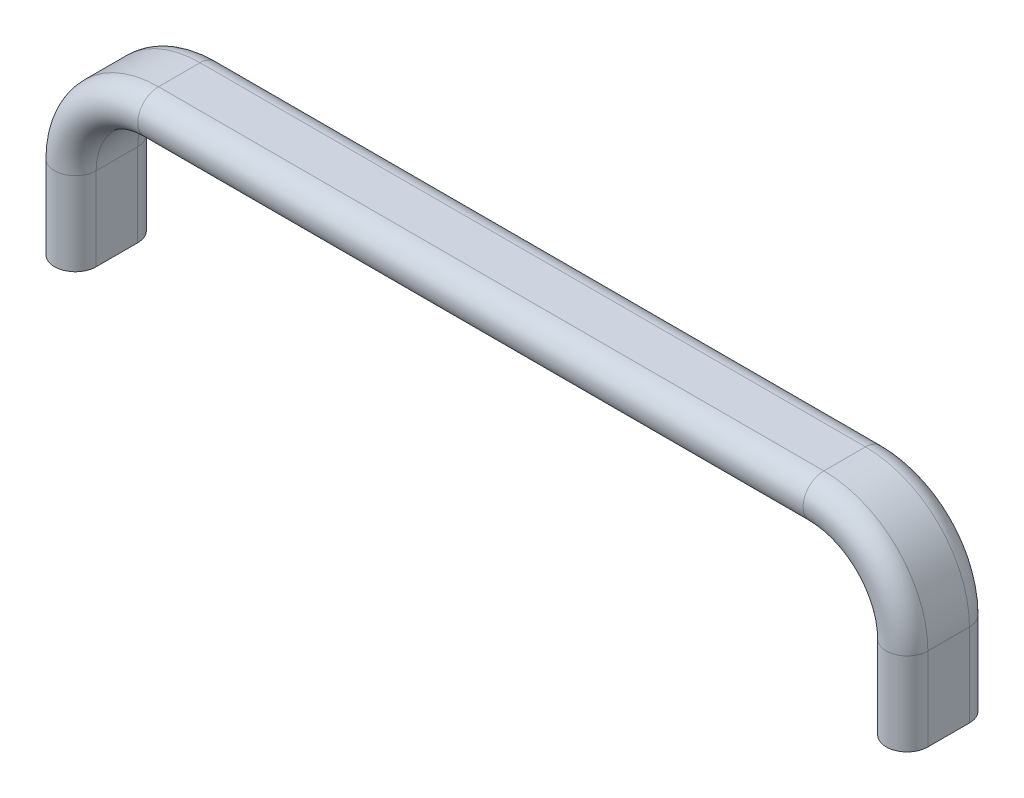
ISO-10303-21;
HEADER;
FILE_DESCRIPTION(('STEP AP214'),'2;1');
FILE_NAME('part.step','',(''),(''),'','','');
FILE_SCHEMA(('AUTOMOTIVE_DESIGN { 1 0 10303 214 1 1 1 1 }'));
ENDSEC;
DATA;
#1=APPLICATION_CONTEXT('core data for automotive mechanical design processes');
#2=APPLICATION_PROTOCOL_DEFINITION('international standard','automotive_design',2000,#1);
#3=PRODUCT_CONTEXT('',#1,'mechanical');
#4=PRODUCT('Part','Part','',(#3));
#5=PRODUCT_RELATED_PRODUCT_CATEGORY('part','',(#4));
#6=PRODUCT_DEFINITION_FORMATION('','',#4);
#7=PRODUCT_DEFINITION_CONTEXT('part definition',#1,'design');
#8=PRODUCT_DEFINITION('design','',#6,#7);
#9=PRODUCT_DEFINITION_SHAPE('','',#8);
#10=(LENGTH_UNIT() NAMED_UNIT(*) SI_UNIT(.MILLI.,.METRE.));
#11=(NAMED_UNIT(*) PLANE_ANGLE_UNIT() SI_UNIT($,.RADIAN.));
#12=(NAMED_UNIT(*) SI_UNIT($,.STERADIAN.) SOLID_ANGLE_UNIT());
#13=UNCERTAINTY_MEASURE_WITH_UNIT(LENGTH_MEASURE(1.E-05),#10,'distance_accuracy_value','');
#14=(GEOMETRIC_REPRESENTATION_CONTEXT(3) GLOBAL_UNCERTAINTY_ASSIGNED_CONTEXT((#13)) GLOBAL_UNIT_ASSIGNED_CONTEXT((#10,
#11,#12)) REPRESENTATION_CONTEXT('',''));
#15=CARTESIAN_POINT('',(0.,0.,0.));
#16=DIRECTION('',(0.,0.,1.));
#17=DIRECTION('',(1.,0.,0.));
#18=AXIS2_PLACEMENT_3D('',#15,#16,#17);
#19=CARTESIAN_POINT('',(100.,0.,-5.));
#20=DIRECTION('',(0.,1.,0.));
#21=DIRECTION('',(0.,0.,-1.));
#22=AXIS2_PLACEMENT_3D('',#19,#20,#21);
#23=PLANE('',#22);
#24=CARTESIAN_POINT('',(100.,0.,-5.));
#25=DIRECTION('',(0.,-1.,0.));
#26=DIRECTION('',(0.,0.,-1.));
#27=AXIS2_PLACEMENT_3D('',#24,#25,#26);
#28=CIRCLE('',#27,5.);
#29=CARTESIAN_POINT('',(95.,0.,-5.00000000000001));
#30=VERTEX_POINT('',#29);
#31=CARTESIAN_POINT('',(105.,0.,-5.00000000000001));
#32=VERTEX_POINT('',#31);
#33=EDGE_CURVE('E278',#30,#32,#28,.T.);
#34=ORIENTED_EDGE('',*,*,#33,.T.);
#35=DIRECTION('',(0.,0.,1.));
#36=VECTOR('',#35,1.);
#37=CARTESIAN_POINT('',(105.,0.,5.00000000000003));
#38=LINE('',#37,#36);
#39=CARTESIAN_POINT('',(105.,0.,5.00000000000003));
#40=VERTEX_POINT('',#39);
#41=EDGE_CURVE('E55',#32,#40,#38,.T.);
#42=ORIENTED_EDGE('',*,*,#41,.T.);
#43=CARTESIAN_POINT('',(100.,0.,5.00000000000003));
#44=DIRECTION('',(0.,-1.,0.));
#45=DIRECTION('',(0.,0.,1.));
#46=AXIS2_PLACEMENT_3D('',#43,#44,#45);
#47=CIRCLE('',#46,5.);
#48=CARTESIAN_POINT('',(95.,0.,5.00000000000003));
#49=VERTEX_POINT('',#48);
#50=EDGE_CURVE('E63',#40,#49,#47,.T.);
#51=ORIENTED_EDGE('',*,*,#50,.T.);
#52=DIRECTION('',(0.,0.,-1.));
#53=VECTOR('',#52,1.);
#54=CARTESIAN_POINT('',(95.,0.,-5.00000000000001));
#55=LINE('',#54,#53);
#56=EDGE_CURVE('E281',#49,#30,#55,.T.);
#57=ORIENTED_EDGE('',*,*,#56,.T.);
#58=EDGE_LOOP('',(#34,#42,#51,#57));
#59=FACE_BOUND('',#58,.T.);
#60=CARTESIAN_POINT('',(100.,0.,0.));
#61=DIRECTION('',(0.,1.,0.));
#62=DIRECTION('',(0.,0.,-1.));
#63=AXIS2_PLACEMENT_3D('',#60,#61,#62);
#64=CIRCLE('',#63,3.00000000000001);
#65=CARTESIAN_POINT('',(100.,0.,-3.00000000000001));
#66=VERTEX_POINT('',#65);
#67=EDGE_CURVE('E453',#66,#66,#64,.T.);
#68=ORIENTED_EDGE('',*,*,#67,.T.);
#69=EDGE_LOOP('',(#68));
#70=FACE_BOUND('',#69,.T.);
#71=ADVANCED_FACE('F37',(#59,#70),#23,.F.);
#72=CARTESIAN_POINT('',(105.,20.,5.00000000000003));
#73=DIRECTION('',(1.,0.,0.));
#74=DIRECTION('',(0.,0.,-1.));
#75=AXIS2_PLACEMENT_3D('',#72,#73,#74);
#76=PLANE('',#75);
#77=DIRECTION('',(0.,0.,1.));
#78=VECTOR('',#77,1.);
#79=CARTESIAN_POINT('',(105.,20.,5.00000000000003));
#80=LINE('',#79,#78);
#81=CARTESIAN_POINT('',(105.,20.,-5.00000000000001));
#82=VERTEX_POINT('',#81);
#83=CARTESIAN_POINT('',(105.,20.,5.00000000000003));
#84=VERTEX_POINT('',#83);
#85=EDGE_CURVE('E247',#82,#84,#80,.T.);
#86=ORIENTED_EDGE('',*,*,#85,.T.);
#87=DIRECTION('',(0.,-1.,0.));
#88=VECTOR('',#87,1.);
#89=CARTESIAN_POINT('',(105.,20.,5.00000000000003));
#90=LINE('',#89,#88);
#91=EDGE_CURVE('E47',#84,#40,#90,.T.);
#92=ORIENTED_EDGE('',*,*,#91,.T.);
#93=ORIENTED_EDGE('',*,*,#41,.F.);
#94=DIRECTION('',(0.,-1.,0.));
#95=VECTOR('',#94,1.);
#96=CARTESIAN_POINT('',(105.,20.,-5.00000000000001));
#97=LINE('',#96,#95);
#98=EDGE_CURVE('E11',#82,#32,#97,.T.);
#99=ORIENTED_EDGE('',*,*,#98,.F.);
#100=EDGE_LOOP('',(#86,#92,#93,#99));
#101=FACE_BOUND('',#100,.T.);
#102=ADVANCED_FACE('F39',(#101),#76,.T.);
#103=CARTESIAN_POINT('',(100.,20.,5.00000000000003));
#104=DIRECTION('',(0.,-1.,0.));
#105=DIRECTION('',(0.,0.,-1.));
#106=AXIS2_PLACEMENT_3D('',#103,#104,#105);
#107=CYLINDRICAL_SURFACE('',#106,5.);
#108=CARTESIAN_POINT('',(100.,20.,5.00000000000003));
#109=DIRECTION('',(0.,-1.,0.));
#110=DIRECTION('',(0.,0.,1.));
#111=AXIS2_PLACEMENT_3D('',#108,#109,#110);
#112=CIRCLE('',#111,5.);
#113=CARTESIAN_POINT('',(95.,20.,5.00000000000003));
#114=VERTEX_POINT('',#113);
#115=EDGE_CURVE('E240',#84,#114,#112,.T.);
#116=ORIENTED_EDGE('',*,*,#115,.T.);
#117=DIRECTION('',(0.,-1.,0.));
#118=VECTOR('',#117,1.);
#119=CARTESIAN_POINT('',(95.,20.,5.00000000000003));
#120=LINE('',#119,#118);
#121=EDGE_CURVE('E242',#114,#49,#120,.T.);
#122=ORIENTED_EDGE('',*,*,#121,.T.);
#123=ORIENTED_EDGE('',*,*,#50,.F.);
#124=ORIENTED_EDGE('',*,*,#91,.F.);
#125=EDGE_LOOP('',(#116,#122,#123,#124));
#126=FACE_BOUND('',#125,.T.);
#127=ADVANCED_FACE('F153',(#126),#107,.T.);
#128=CARTESIAN_POINT('',(95.,20.,-5.00000000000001));
#129=DIRECTION('',(-1.,0.,0.));
#130=DIRECTION('',(0.,0.,1.));
#131=AXIS2_PLACEMENT_3D('',#128,#129,#130);
#132=PLANE('',#131);
#133=DIRECTION('',(0.,0.,-1.));
#134=VECTOR('',#133,1.);
#135=CARTESIAN_POINT('',(95.,20.,-5.00000000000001));
#136=LINE('',#135,#134);
#137=CARTESIAN_POINT('',(95.,20.,-5.00000000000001));
#138=VERTEX_POINT('',#137);
#139=EDGE_CURVE('E248',#114,#138,#136,.T.);
#140=ORIENTED_EDGE('',*,*,#139,.T.);
#141=DIRECTION('',(0.,-1.,0.));
#142=VECTOR('',#141,1.);
#143=CARTESIAN_POINT('',(95.,20.,-5.00000000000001));
#144=LINE('',#143,#142);
#145=EDGE_CURVE('E289',#138,#30,#144,.T.);
#146=ORIENTED_EDGE('',*,*,#145,.T.);
#147=ORIENTED_EDGE('',*,*,#56,.F.);
#148=ORIENTED_EDGE('',*,*,#121,.F.);
#149=EDGE_LOOP('',(#140,#146,#147,#148));
#150=FACE_BOUND('',#149,.T.);
#151=ADVANCED_FACE('F231',(#150),#132,.T.);
#152=CARTESIAN_POINT('',(100.,20.,-5.));
#153=DIRECTION('',(0.,-1.,0.));
#154=DIRECTION('',(0.,0.,-1.));
#155=AXIS2_PLACEMENT_3D('',#152,#153,#154);
#156=CYLINDRICAL_SURFACE('',#155,5.);
#157=CARTESIAN_POINT('',(100.,20.,-5.));
#158=DIRECTION('',(0.,-1.,0.));
#159=DIRECTION('',(0.,0.,-1.));
#160=AXIS2_PLACEMENT_3D('',#157,#158,#159);
#161=CIRCLE('',#160,5.);
#162=EDGE_CURVE('E259',#138,#82,#161,.T.);
#163=ORIENTED_EDGE('',*,*,#162,.T.);
#164=ORIENTED_EDGE('',*,*,#98,.T.);
#165=ORIENTED_EDGE('',*,*,#33,.F.);
#166=ORIENTED_EDGE('',*,*,#145,.F.);
#167=EDGE_LOOP('',(#163,#164,#165,#166));
#168=FACE_BOUND('',#167,.T.);
#169=ADVANCED_FACE('F227',(#168),#156,.T.);
#170=CARTESIAN_POINT('',(80.,20.,0.));
#171=DIRECTION('',(0.,0.,-1.));
#172=DIRECTION('',(-1.,0.,0.));
#173=AXIS2_PLACEMENT_3D('',#170,#171,#172);
#174=CYLINDRICAL_SURFACE('',#173,25.);
#175=DIRECTION('',(0.,0.,1.));
#176=VECTOR('',#175,1.);
#177=CARTESIAN_POINT('',(80.,45.,5.00000000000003));
#178=LINE('',#177,#176);
#179=CARTESIAN_POINT('',(80.,45.,-5.00000000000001));
#180=VERTEX_POINT('',#179);
#181=CARTESIAN_POINT('',(80.,45.,5.00000000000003));
#182=VERTEX_POINT('',#181);
#183=EDGE_CURVE('E400',#180,#182,#178,.T.);
#184=ORIENTED_EDGE('',*,*,#183,.T.);
#185=CARTESIAN_POINT('',(80.,20.,5.00000000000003));
#186=DIRECTION('',(0.,0.,-1.));
#187=DIRECTION('',(-1.,0.,0.));
#188=AXIS2_PLACEMENT_3D('',#185,#186,#187);
#189=CIRCLE('',#188,25.);
#190=EDGE_CURVE('E265',#182,#84,#189,.T.);
#191=ORIENTED_EDGE('',*,*,#190,.T.);
#192=ORIENTED_EDGE('',*,*,#85,.F.);
#193=CARTESIAN_POINT('',(80.,20.,-5.00000000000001));
#194=DIRECTION('',(0.,0.,-1.));
#195=DIRECTION('',(-1.,0.,0.));
#196=AXIS2_PLACEMENT_3D('',#193,#194,#195);
#197=CIRCLE('',#196,25.);
#198=EDGE_CURVE('E269',#180,#82,#197,.T.);
#199=ORIENTED_EDGE('',*,*,#198,.F.);
#200=EDGE_LOOP('',(#184,#191,#192,#199));
#201=FACE_BOUND('',#200,.T.);
#202=ADVANCED_FACE('F223',(#201),#174,.T.);
#203=CARTESIAN_POINT('',(80.,20.,5.00000000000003));
#204=DIRECTION('',(0.,0.,-1.));
#205=DIRECTION('',(-1.,0.,0.));
#206=AXIS2_PLACEMENT_3D('',#203,#204,#205);
#207=TOROIDAL_SURFACE('',#206,20.,5.);
#208=CARTESIAN_POINT('',(80.,40.,5.00000000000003));
#209=DIRECTION('',(1.,0.,0.));
#210=DIRECTION('',(0.,0.,1.));
#211=AXIS2_PLACEMENT_3D('',#208,#209,#210);
#212=CIRCLE('',#211,5.);
#213=CARTESIAN_POINT('',(80.,35.,5.00000000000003));
#214=VERTEX_POINT('',#213);
#215=EDGE_CURVE('E262',#182,#214,#212,.T.);
#216=ORIENTED_EDGE('',*,*,#215,.T.);
#217=CARTESIAN_POINT('',(80.,20.,5.00000000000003));
#218=DIRECTION('',(0.,0.,-1.));
#219=DIRECTION('',(-1.,0.,0.));
#220=AXIS2_PLACEMENT_3D('',#217,#218,#219);
#221=CIRCLE('',#220,15.);
#222=EDGE_CURVE('E253',#214,#114,#221,.T.);
#223=ORIENTED_EDGE('',*,*,#222,.T.);
#224=ORIENTED_EDGE('',*,*,#115,.F.);
#225=ORIENTED_EDGE('',*,*,#190,.F.);
#226=EDGE_LOOP('',(#216,#223,#224,#225));
#227=FACE_BOUND('',#226,.T.);
#228=ADVANCED_FACE('F219',(#227),#207,.T.);
#229=CARTESIAN_POINT('',(80.,20.,0.));
#230=DIRECTION('',(0.,0.,-1.));
#231=DIRECTION('',(-1.,0.,0.));
#232=AXIS2_PLACEMENT_3D('',#229,#230,#231);
#233=CYLINDRICAL_SURFACE('',#232,15.);
#234=DIRECTION('',(0.,0.,-1.));
#235=VECTOR('',#234,1.);
#236=CARTESIAN_POINT('',(80.,35.,-5.00000000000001));
#237=LINE('',#236,#235);
#238=CARTESIAN_POINT('',(80.,35.,-5.00000000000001));
#239=VERTEX_POINT('',#238);
#240=EDGE_CURVE('E395',#214,#239,#237,.T.);
#241=ORIENTED_EDGE('',*,*,#240,.T.);
#242=CARTESIAN_POINT('',(80.,20.,-5.00000000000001));
#243=DIRECTION('',(0.,0.,-1.));
#244=DIRECTION('',(-1.,0.,0.));
#245=AXIS2_PLACEMENT_3D('',#242,#243,#244);
#246=CIRCLE('',#245,15.);
#247=EDGE_CURVE('E255',#239,#138,#246,.T.);
#248=ORIENTED_EDGE('',*,*,#247,.T.);
#249=ORIENTED_EDGE('',*,*,#139,.F.);
#250=ORIENTED_EDGE('',*,*,#222,.F.);
#251=EDGE_LOOP('',(#241,#248,#249,#250));
#252=FACE_BOUND('',#251,.T.);
#253=ADVANCED_FACE('F215',(#252),#233,.F.);
#254=CARTESIAN_POINT('',(80.,20.,-5.));
#255=DIRECTION('',(0.,0.,-1.));
#256=DIRECTION('',(-1.,0.,0.));
#257=AXIS2_PLACEMENT_3D('',#254,#255,#256);
#258=TOROIDAL_SURFACE('',#257,20.,5.);
#259=CARTESIAN_POINT('',(80.,40.,-5.));
#260=DIRECTION('',(1.,0.,0.));
#261=DIRECTION('',(0.,0.,-1.));
#262=AXIS2_PLACEMENT_3D('',#259,#260,#261);
#263=CIRCLE('',#262,5.);
#264=EDGE_CURVE('E391',#239,#180,#263,.T.);
#265=ORIENTED_EDGE('',*,*,#264,.T.);
#266=ORIENTED_EDGE('',*,*,#198,.T.);
#267=ORIENTED_EDGE('',*,*,#162,.F.);
#268=ORIENTED_EDGE('',*,*,#247,.F.);
#269=EDGE_LOOP('',(#265,#266,#267,#268));
#270=FACE_BOUND('',#269,.T.);
#271=ADVANCED_FACE('F211',(#270),#258,.T.);
#272=CARTESIAN_POINT('',(-80.,45.,5.00000000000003));
#273=DIRECTION('',(0.,1.,0.));
#274=DIRECTION('',(-1.,0.,0.));
#275=AXIS2_PLACEMENT_3D('',#272,#273,#274);
#276=PLANE('',#275);
#277=DIRECTION('',(0.,0.,1.));
#278=VECTOR('',#277,1.);
#279=CARTESIAN_POINT('',(-80.,45.,5.00000000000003));
#280=LINE('',#279,#278);
#281=CARTESIAN_POINT('',(-80.,45.,-5.00000000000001));
#282=VERTEX_POINT('',#281);
#283=CARTESIAN_POINT('',(-80.,45.,5.00000000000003));
#284=VERTEX_POINT('',#283);
#285=EDGE_CURVE('E372',#282,#284,#280,.T.);
#286=ORIENTED_EDGE('',*,*,#285,.T.);
#287=DIRECTION('',(1.,0.,0.));
#288=VECTOR('',#287,1.);
#289=CARTESIAN_POINT('',(-80.,45.,5.00000000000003));
#290=LINE('',#289,#288);
#291=EDGE_CURVE('E412',#284,#182,#290,.T.);
#292=ORIENTED_EDGE('',*,*,#291,.T.);
#293=ORIENTED_EDGE('',*,*,#183,.F.);
#294=DIRECTION('',(1.,0.,0.));
#295=VECTOR('',#294,1.);
#296=CARTESIAN_POINT('',(-80.,45.,-5.00000000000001));
#297=LINE('',#296,#295);
#298=EDGE_CURVE('E416',#282,#180,#297,.T.);
#299=ORIENTED_EDGE('',*,*,#298,.F.);
#300=EDGE_LOOP('',(#286,#292,#293,#299));
#301=FACE_BOUND('',#300,.T.);
#302=ADVANCED_FACE('F207',(#301),#276,.T.);
#303=CARTESIAN_POINT('',(-80.,40.,5.00000000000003));
#304=DIRECTION('',(1.,0.,0.));
#305=DIRECTION('',(0.,1.,0.));
#306=AXIS2_PLACEMENT_3D('',#303,#304,#305);
#307=CYLINDRICAL_SURFACE('',#306,5.);
#308=CARTESIAN_POINT('',(-80.,40.,5.00000000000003));
#309=DIRECTION('',(1.,0.,0.));
#310=DIRECTION('',(0.,0.,1.));
#311=AXIS2_PLACEMENT_3D('',#308,#309,#310);
#312=CIRCLE('',#311,5.);
#313=CARTESIAN_POINT('',(-80.,35.,5.00000000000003));
#314=VERTEX_POINT('',#313);
#315=EDGE_CURVE('E368',#284,#314,#312,.T.);
#316=ORIENTED_EDGE('',*,*,#315,.T.);
#317=DIRECTION('',(1.,0.,0.));
#318=VECTOR('',#317,1.);
#319=CARTESIAN_POINT('',(-80.,35.,5.00000000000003));
#320=LINE('',#319,#318);
#321=EDGE_CURVE('E408',#314,#214,#320,.T.);
#322=ORIENTED_EDGE('',*,*,#321,.T.);
#323=ORIENTED_EDGE('',*,*,#215,.F.);
#324=ORIENTED_EDGE('',*,*,#291,.F.);
#325=EDGE_LOOP('',(#316,#322,#323,#324));
#326=FACE_BOUND('',#325,.T.);
#327=ADVANCED_FACE('F203',(#326),#307,.T.);
#328=CARTESIAN_POINT('',(-80.,35.,-5.00000000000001));
#329=DIRECTION('',(0.,-1.,0.));
#330=DIRECTION('',(1.,0.,0.));
#331=AXIS2_PLACEMENT_3D('',#328,#329,#330);
#332=PLANE('',#331);
#333=DIRECTION('',(0.,0.,-1.));
#334=VECTOR('',#333,1.);
#335=CARTESIAN_POINT('',(-80.,35.,-5.00000000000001));
#336=LINE('',#335,#334);
#337=CARTESIAN_POINT('',(-80.,35.,-5.00000000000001));
#338=VERTEX_POINT('',#337);
#339=EDGE_CURVE('E364',#314,#338,#336,.T.);
#340=ORIENTED_EDGE('',*,*,#339,.T.);
#341=DIRECTION('',(1.,0.,0.));
#342=VECTOR('',#341,1.);
#343=CARTESIAN_POINT('',(-80.,35.,-5.00000000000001));
#344=LINE('',#343,#342);
#345=EDGE_CURVE('E404',#338,#239,#344,.T.);
#346=ORIENTED_EDGE('',*,*,#345,.T.);
#347=ORIENTED_EDGE('',*,*,#240,.F.);
#348=ORIENTED_EDGE('',*,*,#321,.F.);
#349=EDGE_LOOP('',(#340,#346,#347,#348));
#350=FACE_BOUND('',#349,.T.);
#351=ADVANCED_FACE('F199',(#350),#332,.T.);
#352=CARTESIAN_POINT('',(-80.,40.,-5.));
#353=DIRECTION('',(1.,0.,0.));
#354=DIRECTION('',(0.,1.,0.));
#355=AXIS2_PLACEMENT_3D('',#352,#353,#354);
#356=CYLINDRICAL_SURFACE('',#355,5.);
#357=CARTESIAN_POINT('',(-80.,40.,-5.));
#358=DIRECTION('',(1.,0.,0.));
#359=DIRECTION('',(0.,0.,-1.));
#360=AXIS2_PLACEMENT_3D('',#357,#358,#359);
#361=CIRCLE('',#360,5.);
#362=EDGE_CURVE('E360',#338,#282,#361,.T.);
#363=ORIENTED_EDGE('',*,*,#362,.T.);
#364=ORIENTED_EDGE('',*,*,#298,.T.);
#365=ORIENTED_EDGE('',*,*,#264,.F.);
#366=ORIENTED_EDGE('',*,*,#345,.F.);
#367=EDGE_LOOP('',(#363,#364,#365,#366));
#368=FACE_BOUND('',#367,.T.);
#369=ADVANCED_FACE('F195',(#368),#356,.T.);
#370=CARTESIAN_POINT('',(-80.,20.,0.));
#371=DIRECTION('',(0.,0.,-1.));
#372=DIRECTION('',(-1.,0.,0.));
#373=AXIS2_PLACEMENT_3D('',#370,#371,#372);
#374=CYLINDRICAL_SURFACE('',#373,25.);
#375=DIRECTION('',(0.,0.,1.));
#376=VECTOR('',#375,1.);
#377=CARTESIAN_POINT('',(-105.,20.,5.00000000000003));
#378=LINE('',#377,#376);
#379=CARTESIAN_POINT('',(-105.,20.,-5.00000000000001));
#380=VERTEX_POINT('',#379);
#381=CARTESIAN_POINT('',(-105.,20.,5.00000000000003));
#382=VERTEX_POINT('',#381);
#383=EDGE_CURVE('E326',#380,#382,#378,.T.);
#384=ORIENTED_EDGE('',*,*,#383,.T.);
#385=CARTESIAN_POINT('',(-80.,20.,5.00000000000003));
#386=DIRECTION('',(0.,0.,-1.));
#387=DIRECTION('',(-1.,0.,0.));
#388=AXIS2_PLACEMENT_3D('',#385,#386,#387);
#389=CIRCLE('',#388,25.);
#390=EDGE_CURVE('E384',#382,#284,#389,.T.);
#391=ORIENTED_EDGE('',*,*,#390,.T.);
#392=ORIENTED_EDGE('',*,*,#285,.F.);
#393=CARTESIAN_POINT('',(-80.,20.,-5.00000000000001));
#394=DIRECTION('',(0.,0.,-1.));
#395=DIRECTION('',(-1.,0.,0.));
#396=AXIS2_PLACEMENT_3D('',#393,#394,#395);
#397=CIRCLE('',#396,25.);
#398=EDGE_CURVE('E388',#380,#282,#397,.T.);
#399=ORIENTED_EDGE('',*,*,#398,.F.);
#400=EDGE_LOOP('',(#384,#391,#392,#399));
#401=FACE_BOUND('',#400,.T.);
#402=ADVANCED_FACE('F191',(#401),#374,.T.);
#403=CARTESIAN_POINT('',(-80.,20.,5.00000000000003));
#404=DIRECTION('',(0.,0.,-1.));
#405=DIRECTION('',(-1.,0.,0.));
#406=AXIS2_PLACEMENT_3D('',#403,#404,#405);
#407=TOROIDAL_SURFACE('',#406,20.,5.);
#408=CARTESIAN_POINT('',(-100.,20.,5.00000000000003));
#409=DIRECTION('',(0.,1.,0.));
#410=DIRECTION('',(0.,0.,1.));
#411=AXIS2_PLACEMENT_3D('',#408,#409,#410);
#412=CIRCLE('',#411,5.);
#413=CARTESIAN_POINT('',(-95.,20.,5.00000000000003));
#414=VERTEX_POINT('',#413);
#415=EDGE_CURVE('E331',#382,#414,#412,.T.);
#416=ORIENTED_EDGE('',*,*,#415,.T.);
#417=CARTESIAN_POINT('',(-80.,20.,5.00000000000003));
#418=DIRECTION('',(0.,0.,-1.));
#419=DIRECTION('',(-1.,0.,0.));
#420=AXIS2_PLACEMENT_3D('',#417,#418,#419);
#421=CIRCLE('',#420,15.);
#422=EDGE_CURVE('E380',#414,#314,#421,.T.);
#423=ORIENTED_EDGE('',*,*,#422,.T.);
#424=ORIENTED_EDGE('',*,*,#315,.F.);
#425=ORIENTED_EDGE('',*,*,#390,.F.);
#426=EDGE_LOOP('',(#416,#423,#424,#425));
#427=FACE_BOUND('',#426,.T.);
#428=ADVANCED_FACE('F187',(#427),#407,.T.);
#429=CARTESIAN_POINT('',(-80.,20.,0.));
#430=DIRECTION('',(0.,0.,-1.));
#431=DIRECTION('',(-1.,0.,0.));
#432=AXIS2_PLACEMENT_3D('',#429,#430,#431);
#433=CYLINDRICAL_SURFACE('',#432,15.);
#434=DIRECTION('',(0.,0.,-1.));
#435=VECTOR('',#434,1.);
#436=CARTESIAN_POINT('',(-95.,20.,-5.00000000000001));
#437=LINE('',#436,#435);
#438=CARTESIAN_POINT('',(-95.,20.,-5.00000000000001));
#439=VERTEX_POINT('',#438);
#440=EDGE_CURVE('E335',#414,#439,#437,.T.);
#441=ORIENTED_EDGE('',*,*,#440,.T.);
#442=CARTESIAN_POINT('',(-80.,20.,-5.00000000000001));
#443=DIRECTION('',(0.,0.,-1.));
#444=DIRECTION('',(-1.,0.,0.));
#445=AXIS2_PLACEMENT_3D('',#442,#443,#444);
#446=CIRCLE('',#445,15.);
#447=EDGE_CURVE('E376',#439,#338,#446,.T.);
#448=ORIENTED_EDGE('',*,*,#447,.T.);
#449=ORIENTED_EDGE('',*,*,#339,.F.);
#450=ORIENTED_EDGE('',*,*,#422,.F.);
#451=EDGE_LOOP('',(#441,#448,#449,#450));
#452=FACE_BOUND('',#451,.T.);
#453=ADVANCED_FACE('F183',(#452),#433,.F.);
#454=CARTESIAN_POINT('',(-80.,20.,-5.));
#455=DIRECTION('',(0.,0.,-1.));
#456=DIRECTION('',(-1.,0.,0.));
#457=AXIS2_PLACEMENT_3D('',#454,#455,#456);
#458=TOROIDAL_SURFACE('',#457,20.,5.);
#459=CARTESIAN_POINT('',(-100.,20.,-5.));
#460=DIRECTION('',(0.,1.,0.));
#461=DIRECTION('',(0.,0.,-1.));
#462=AXIS2_PLACEMENT_3D('',#459,#460,#461);
#463=CIRCLE('',#462,5.);
#464=EDGE_CURVE('E322',#439,#380,#463,.T.);
#465=ORIENTED_EDGE('',*,*,#464,.T.);
#466=ORIENTED_EDGE('',*,*,#398,.T.);
#467=ORIENTED_EDGE('',*,*,#362,.F.);
#468=ORIENTED_EDGE('',*,*,#447,.F.);
#469=EDGE_LOOP('',(#465,#466,#467,#468));
#470=FACE_BOUND('',#469,.T.);
#471=ADVANCED_FACE('F179',(#470),#458,.T.);
#472=CARTESIAN_POINT('',(-100.,20.,-5.));
#473=DIRECTION('',(0.,-1.,0.));
#474=DIRECTION('',(0.,0.,-1.));
#475=AXIS2_PLACEMENT_3D('',#472,#473,#474);
#476=CYLINDRICAL_SURFACE('',#475,5.);
#477=CARTESIAN_POINT('',(-100.,0.,-5.));
#478=DIRECTION('',(0.,1.,0.));
#479=DIRECTION('',(0.,0.,-1.));
#480=AXIS2_PLACEMENT_3D('',#477,#478,#479);
#481=CIRCLE('',#480,5.);
#482=CARTESIAN_POINT('',(-95.,0.,-5.00000000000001));
#483=VERTEX_POINT('',#482);
#484=CARTESIAN_POINT('',(-105.,0.,-5.00000000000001));
#485=VERTEX_POINT('',#484);
#486=EDGE_CURVE('E298',#483,#485,#481,.T.);
#487=ORIENTED_EDGE('',*,*,#486,.T.);
#488=DIRECTION('',(0.,-1.,0.));
#489=VECTOR('',#488,1.);
#490=CARTESIAN_POINT('',(-105.,20.,-5.00000000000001));
#491=LINE('',#490,#489);
#492=EDGE_CURVE('E356',#380,#485,#491,.T.);
#493=ORIENTED_EDGE('',*,*,#492,.F.);
#494=ORIENTED_EDGE('',*,*,#464,.F.);
#495=DIRECTION('',(0.,-1.,0.));
#496=VECTOR('',#495,1.);
#497=CARTESIAN_POINT('',(-95.,20.,-5.00000000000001));
#498=LINE('',#497,#496);
#499=EDGE_CURVE('E337',#439,#483,#498,.T.);
#500=ORIENTED_EDGE('',*,*,#499,.T.);
#501=EDGE_LOOP('',(#487,#493,#494,#500));
#502=FACE_BOUND('',#501,.T.);
#503=ADVANCED_FACE('F175',(#502),#476,.T.);
#504=CARTESIAN_POINT('',(-105.,20.,5.00000000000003));
#505=DIRECTION('',(1.,0.,0.));
#506=DIRECTION('',(0.,0.,-1.));
#507=AXIS2_PLACEMENT_3D('',#504,#505,#506);
#508=PLANE('',#507);
#509=DIRECTION('',(0.,0.,1.));
#510=VECTOR('',#509,1.);
#511=CARTESIAN_POINT('',(-105.,0.,5.00000000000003));
#512=LINE('',#511,#510);
#513=CARTESIAN_POINT('',(-105.,0.,5.00000000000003));
#514=VERTEX_POINT('',#513);
#515=EDGE_CURVE('E306',#485,#514,#512,.T.);
#516=ORIENTED_EDGE('',*,*,#515,.T.);
#517=DIRECTION('',(0.,-1.,0.));
#518=VECTOR('',#517,1.);
#519=CARTESIAN_POINT('',(-105.,20.,5.00000000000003));
#520=LINE('',#519,#518);
#521=EDGE_CURVE('E352',#382,#514,#520,.T.);
#522=ORIENTED_EDGE('',*,*,#521,.F.);
#523=ORIENTED_EDGE('',*,*,#383,.F.);
#524=ORIENTED_EDGE('',*,*,#492,.T.);
#525=EDGE_LOOP('',(#516,#522,#523,#524));
#526=FACE_BOUND('',#525,.T.);
#527=ADVANCED_FACE('F171',(#526),#508,.F.);
#528=CARTESIAN_POINT('',(-100.,20.,5.00000000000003));
#529=DIRECTION('',(0.,-1.,0.));
#530=DIRECTION('',(0.,0.,-1.));
#531=AXIS2_PLACEMENT_3D('',#528,#529,#530);
#532=CYLINDRICAL_SURFACE('',#531,5.);
#533=CARTESIAN_POINT('',(-100.,0.,5.00000000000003));
#534=DIRECTION('',(0.,1.,0.));
#535=DIRECTION('',(0.,0.,1.));
#536=AXIS2_PLACEMENT_3D('',#533,#534,#535);
#537=CIRCLE('',#536,5.);
#538=CARTESIAN_POINT('',(-95.,0.,5.00000000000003));
#539=VERTEX_POINT('',#538);
#540=EDGE_CURVE('E341',#514,#539,#537,.T.);
#541=ORIENTED_EDGE('',*,*,#540,.T.);
#542=DIRECTION('',(0.,-1.,0.));
#543=VECTOR('',#542,1.);
#544=CARTESIAN_POINT('',(-95.,20.,5.00000000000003));
#545=LINE('',#544,#543);
#546=EDGE_CURVE('E348',#414,#539,#545,.T.);
#547=ORIENTED_EDGE('',*,*,#546,.F.);
#548=ORIENTED_EDGE('',*,*,#415,.F.);
#549=ORIENTED_EDGE('',*,*,#521,.T.);
#550=EDGE_LOOP('',(#541,#547,#548,#549));
#551=FACE_BOUND('',#550,.T.);
#552=ADVANCED_FACE('F167',(#551),#532,.T.);
#553=CARTESIAN_POINT('',(-95.,20.,-5.00000000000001));
#554=DIRECTION('',(-1.,0.,0.));
#555=DIRECTION('',(0.,0.,1.));
#556=AXIS2_PLACEMENT_3D('',#553,#554,#555);
#557=PLANE('',#556);
#558=DIRECTION('',(0.,0.,-1.));
#559=VECTOR('',#558,1.);
#560=CARTESIAN_POINT('',(-95.,0.,-5.00000000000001));
#561=LINE('',#560,#559);
#562=EDGE_CURVE('E327',#539,#483,#561,.T.);
#563=ORIENTED_EDGE('',*,*,#562,.T.);
#564=ORIENTED_EDGE('',*,*,#499,.F.);
#565=ORIENTED_EDGE('',*,*,#440,.F.);
#566=ORIENTED_EDGE('',*,*,#546,.T.);
#567=EDGE_LOOP('',(#563,#564,#565,#566));
#568=FACE_BOUND('',#567,.T.);
#569=ADVANCED_FACE('F163',(#568),#557,.F.);
#570=CARTESIAN_POINT('',(-100.,0.,-5.));
#571=DIRECTION('',(0.,-1.,0.));
#572=DIRECTION('',(0.,0.,-1.));
#573=AXIS2_PLACEMENT_3D('',#570,#571,#572);
#574=PLANE('',#573);
#575=CARTESIAN_POINT('',(-100.,0.,0.));
#576=DIRECTION('',(0.,-1.,0.));
#577=DIRECTION('',(0.,0.,-1.));
#578=AXIS2_PLACEMENT_3D('',#575,#576,#577);
#579=CIRCLE('',#578,3.00000000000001);
#580=CARTESIAN_POINT('',(-100.,0.,-3.00000000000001));
#581=VERTEX_POINT('',#580);
#582=EDGE_CURVE('E310',#581,#581,#579,.T.);
#583=ORIENTED_EDGE('',*,*,#582,.F.);
#584=EDGE_LOOP('',(#583));
#585=FACE_BOUND('',#584,.T.);
#586=ORIENTED_EDGE('',*,*,#486,.F.);
#587=ORIENTED_EDGE('',*,*,#562,.F.);
#588=ORIENTED_EDGE('',*,*,#540,.F.);
#589=ORIENTED_EDGE('',*,*,#515,.F.);
#590=EDGE_LOOP('',(#586,#587,#588,#589));
#591=FACE_BOUND('',#590,.T.);
#592=ADVANCED_FACE('F159',(#585,#591),#574,.T.);
#593=CARTESIAN_POINT('',(-100.,12.,0.));
#594=DIRECTION('',(0.,-1.,0.));
#595=DIRECTION('',(0.,0.,-1.));
#596=AXIS2_PLACEMENT_3D('',#593,#594,#595);
#597=PLANE('',#596);
#598=CARTESIAN_POINT('',(-100.,12.,0.));
#599=DIRECTION('',(0.,-1.,0.));
#600=DIRECTION('',(0.,0.,-1.));
#601=AXIS2_PLACEMENT_3D('',#598,#599,#600);
#602=CIRCLE('',#601,3.00000000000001);
#603=CARTESIAN_POINT('',(-100.,12.,-3.00000000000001));
#604=VERTEX_POINT('',#603);
#605=EDGE_CURVE('E299',#604,#604,#602,.T.);
#606=ORIENTED_EDGE('',*,*,#605,.T.);
#607=EDGE_LOOP('',(#606));
#608=FACE_BOUND('',#607,.T.);
#609=CARTESIAN_POINT('',(-100.,12.,0.));
#610=DIRECTION('',(0.,-1.,0.));
#611=DIRECTION('',(0.,0.,-1.));
#612=AXIS2_PLACEMENT_3D('',#609,#610,#611);
#613=CIRCLE('',#612,2.5);
#614=CARTESIAN_POINT('',(-100.,12.,-2.5));
#615=VERTEX_POINT('',#614);
#616=EDGE_CURVE('E295',#615,#615,#613,.F.);
#617=ORIENTED_EDGE('',*,*,#616,.T.);
#618=EDGE_LOOP('',(#617));
#619=FACE_BOUND('',#618,.T.);
#620=ADVANCED_FACE('F162',(#608,#619),#597,.T.);
#621=CARTESIAN_POINT('',(-100.,12.,0.));
#622=DIRECTION('',(0.,-1.,0.));
#623=DIRECTION('',(0.,0.,-1.));
#624=AXIS2_PLACEMENT_3D('',#621,#622,#623);
#625=CYLINDRICAL_SURFACE('',#624,3.00000000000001);
#626=ORIENTED_EDGE('',*,*,#605,.F.);
#627=EDGE_LOOP('',(#626));
#628=FACE_BOUND('',#627,.T.);
#629=ORIENTED_EDGE('',*,*,#582,.T.);
#630=EDGE_LOOP('',(#629));
#631=FACE_BOUND('',#630,.T.);
#632=ADVANCED_FACE('F477',(#628,#631),#625,.F.);
#633=CARTESIAN_POINT('',(-100.,16.,0.));
#634=DIRECTION('',(0.,-1.,0.));
#635=DIRECTION('',(0.,0.,-1.));
#636=AXIS2_PLACEMENT_3D('',#633,#634,#635);
#637=CYLINDRICAL_SURFACE('',#636,2.5);
#638=CARTESIAN_POINT('',(-100.,16.,0.));
#639=DIRECTION('',(0.,1.,0.));
#640=DIRECTION('',(0.,0.,1.));
#641=AXIS2_PLACEMENT_3D('',#638,#639,#640);
#642=CIRCLE('',#641,2.5);
#643=CARTESIAN_POINT('',(-100.,16.,2.5));
#644=VERTEX_POINT('',#643);
#645=EDGE_CURVE('E317',#644,#644,#642,.T.);
#646=ORIENTED_EDGE('',*,*,#645,.T.);
#647=EDGE_LOOP('',(#646));
#648=FACE_BOUND('',#647,.T.);
#649=ORIENTED_EDGE('',*,*,#616,.F.);
#650=EDGE_LOOP('',(#649));
#651=FACE_BOUND('',#650,.T.);
#652=ADVANCED_FACE('F157',(#648,#651),#637,.F.);
#653=CARTESIAN_POINT('',(-100.,17.443375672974,0.));
#654=DIRECTION('',(0.,-1.,0.));
#655=DIRECTION('',(0.,0.,-1.));
#656=AXIS2_PLACEMENT_3D('',#653,#654,#655);
#657=CONICAL_SURFACE('',#656,0.,1.0471975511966);
#658=ORIENTED_EDGE('',*,*,#645,.F.);
#659=EDGE_LOOP('',(#658));
#660=FACE_BOUND('',#659,.T.);
#661=CARTESIAN_POINT('',(-100.,17.443375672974,0.));
#662=VERTEX_POINT('',#661);
#663=VERTEX_LOOP('',#662);
#664=FACE_BOUND('',#663,.T.);
#665=ADVANCED_FACE('F466',(#660,#664),#657,.F.);
#666=CARTESIAN_POINT('',(100.,12.,0.));
#667=DIRECTION('',(0.,-1.,0.));
#668=DIRECTION('',(0.,0.,-1.));
#669=AXIS2_PLACEMENT_3D('',#666,#667,#668);
#670=CYLINDRICAL_SURFACE('',#669,3.00000000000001);
#671=CARTESIAN_POINT('',(100.,12.,0.));
#672=DIRECTION('',(0.,1.,0.));
#673=DIRECTION('',(0.,0.,-1.));
#674=AXIS2_PLACEMENT_3D('',#671,#672,#673);
#675=CIRCLE('',#674,3.00000000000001);
#676=CARTESIAN_POINT('',(100.,12.,-3.00000000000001));
#677=VERTEX_POINT('',#676);
#678=EDGE_CURVE('E447',#677,#677,#675,.T.);
#679=ORIENTED_EDGE('',*,*,#678,.T.);
#680=EDGE_LOOP('',(#679));
#681=FACE_BOUND('',#680,.T.);
#682=ORIENTED_EDGE('',*,*,#67,.F.);
#683=EDGE_LOOP('',(#682));
#684=FACE_BOUND('',#683,.T.);
#685=ADVANCED_FACE('F464',(#681,#684),#670,.F.);
#686=CARTESIAN_POINT('',(100.,12.,0.));
#687=DIRECTION('',(0.,-1.,0.));
#688=DIRECTION('',(0.,0.,-1.));
#689=AXIS2_PLACEMENT_3D('',#686,#687,#688);
#690=PLANE('',#689);
#691=CARTESIAN_POINT('',(100.,12.,0.));
#692=DIRECTION('',(0.,-1.,0.));
#693=DIRECTION('',(0.,0.,-1.));
#694=AXIS2_PLACEMENT_3D('',#691,#692,#693);
#695=CIRCLE('',#694,2.5);
#696=CARTESIAN_POINT('',(100.,12.,-2.5));
#697=VERTEX_POINT('',#696);
#698=EDGE_CURVE('E41',#697,#697,#695,.T.);
#699=ORIENTED_EDGE('',*,*,#698,.F.);
#700=EDGE_LOOP('',(#699));
#701=FACE_BOUND('',#700,.T.);
#702=ORIENTED_EDGE('',*,*,#678,.F.);
#703=EDGE_LOOP('',(#702));
#704=FACE_BOUND('',#703,.T.);
#705=ADVANCED_FACE('F142',(#701,#704),#690,.T.);
#706=CARTESIAN_POINT('',(100.,16.,0.));
#707=DIRECTION('',(0.,-1.,0.));
#708=DIRECTION('',(0.,0.,-1.));
#709=AXIS2_PLACEMENT_3D('',#706,#707,#708);
#710=CYLINDRICAL_SURFACE('',#709,2.5);
#711=CARTESIAN_POINT('',(100.,16.,0.));
#712=DIRECTION('',(0.,-1.,0.));
#713=DIRECTION('',(0.,0.,1.));
#714=AXIS2_PLACEMENT_3D('',#711,#712,#713);
#715=CIRCLE('',#714,2.5);
#716=CARTESIAN_POINT('',(100.,16.,2.5));
#717=VERTEX_POINT('',#716);
#718=EDGE_CURVE('E458',#717,#717,#715,.T.);
#719=ORIENTED_EDGE('',*,*,#718,.F.);
#720=EDGE_LOOP('',(#719));
#721=FACE_BOUND('',#720,.T.);
#722=ORIENTED_EDGE('',*,*,#698,.T.);
#723=EDGE_LOOP('',(#722));
#724=FACE_BOUND('',#723,.T.);
#725=ADVANCED_FACE('F136',(#721,#724),#710,.F.);
#726=CARTESIAN_POINT('',(100.,17.443375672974,0.));
#727=DIRECTION('',(0.,-1.,0.));
#728=DIRECTION('',(0.,0.,-1.));
#729=AXIS2_PLACEMENT_3D('',#726,#727,#728);
#730=CONICAL_SURFACE('',#729,0.,1.0471975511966);
#731=ORIENTED_EDGE('',*,*,#718,.T.);
#732=EDGE_LOOP('',(#731));
#733=FACE_BOUND('',#732,.T.);
#734=CARTESIAN_POINT('',(100.,17.443375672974,0.));
#735=VERTEX_POINT('',#734);
#736=VERTEX_LOOP('',#735);
#737=FACE_BOUND('',#736,.T.);
#738=ADVANCED_FACE('F134',(#733,#737),#730,.F.);
#739=CLOSED_SHELL('',(#71,#102,#127,#151,#169,#202,#228,#253,#271,#302,#327,#351,#369,#402,#428,
#453,#471,#503,#527,#552,#569,#592,#620,#632,#652,#665,#685,#705,#725,#738));
#740=MANIFOLD_SOLID_BREP('B2',#739);
#741=ADVANCED_BREP_SHAPE_REPRESENTATION('',(#18,#740),#14);
#742=SHAPE_DEFINITION_REPRESENTATION(#9,#741);
ENDSEC;
END-ISO-10303-21;
